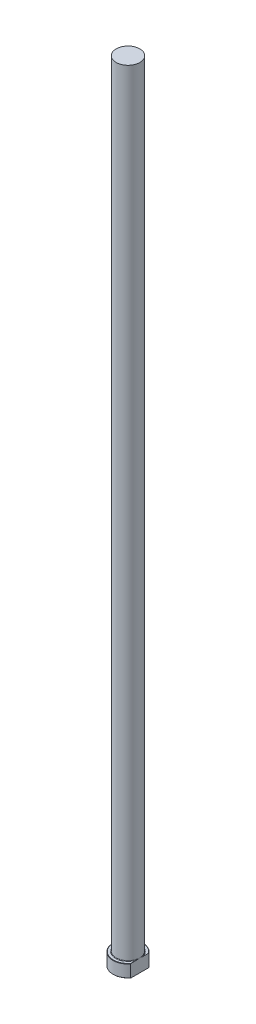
from build123d import *
from build123d.topology import SkipClean

# Parameters (mm, degrees)
CHAMFER1_SIZE    = 0.2
FILLET1_R        = 0.3
KEYED_HEAD_DEPTH = 501.180467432


with BuildPart() as part:
    # Sketch1 → Revolve1 (revolve)
    with BuildSketch(Plane.XY, mode=Mode.PRIVATE) as revolve1_sk:
        Polygon((0, 0), (-9.5, 0), (-9.5, 8), (-7.5, 8), (-7.5, 500), (0, 500), align=None)
    revolve(revolve1_sk.sketch.rotate(Axis((0, 259.958771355, 0), (0, -1, 0)), 270), axis=Axis((0, 259.958771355, 0), (0, -1, 0)))

    # Chamfer1
    chamfer1_edges = [part.edges().sort_by_distance(p)[0] for p in [
        (0, 8, -9.5),
        (0, 0, -9.5),
    ]]
    chamfer(chamfer1_edges, length=CHAMFER1_SIZE)

    # Fillet1
    fillet1_edges = [part.edges().sort_by_distance(p)[0] for p in [
        (0, 8, -7.5),
    ]]
    fillet(fillet1_edges, radius=FILLET1_R)

    # Sketch2 → KEYED HEAD (cut, through all)
    with SkipClean():  # the faces are left unmerged after this step: merging them gives an invalid solid
        with BuildSketch(Plane(origin=(0, 0, 0), x_dir=(1, 0, 0), z_dir=(0, 1, 0))):
            with BuildLine():
                Line((7.5, -5.830951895), (7.5, 5.830951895))
                ThreePointArc((7.5, 5.830951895), (9.5, 0), (7.5, -5.830951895))
            make_face()
        extrude(amount=KEYED_HEAD_DEPTH, mode=Mode.SUBTRACT)


solid = part.part
